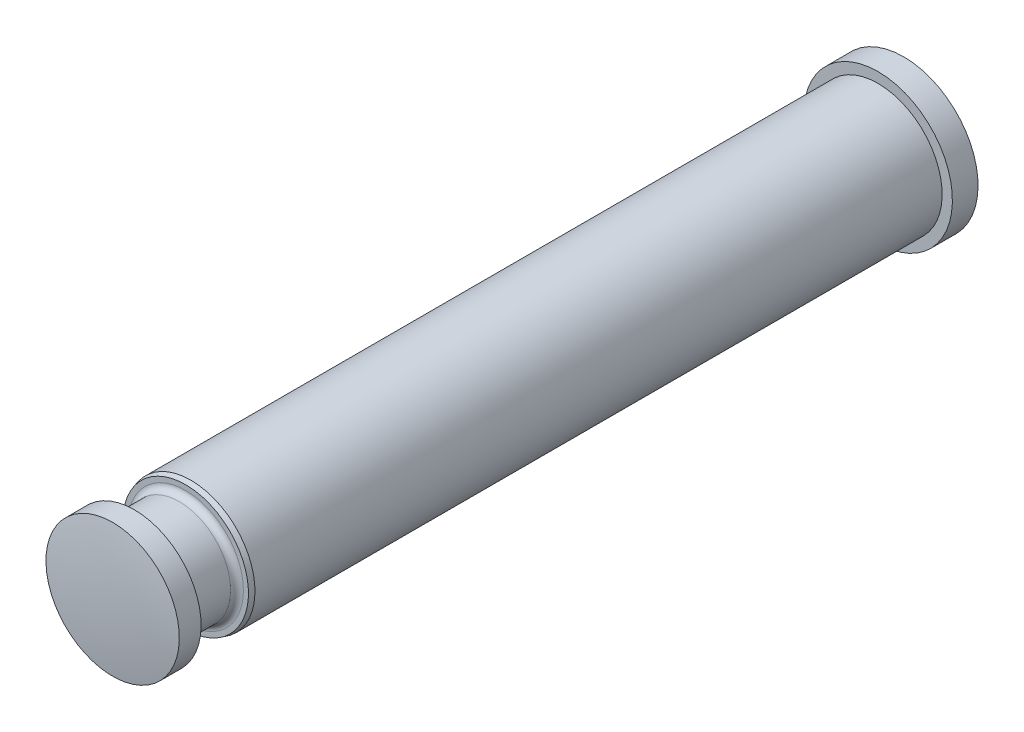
ISO-10303-21;
HEADER;
FILE_DESCRIPTION(('STEP AP214'),'2;1');
FILE_NAME('part.step','',(''),(''),'','','');
FILE_SCHEMA(('AUTOMOTIVE_DESIGN { 1 0 10303 214 1 1 1 1 }'));
ENDSEC;
DATA;
#1=APPLICATION_CONTEXT('core data for automotive mechanical design processes');
#2=APPLICATION_PROTOCOL_DEFINITION('international standard','automotive_design',2000,#1);
#3=PRODUCT_CONTEXT('',#1,'mechanical');
#4=PRODUCT('Part','Part','',(#3));
#5=PRODUCT_RELATED_PRODUCT_CATEGORY('part','',(#4));
#6=PRODUCT_DEFINITION_FORMATION('','',#4);
#7=PRODUCT_DEFINITION_CONTEXT('part definition',#1,'design');
#8=PRODUCT_DEFINITION('design','',#6,#7);
#9=PRODUCT_DEFINITION_SHAPE('','',#8);
#10=(LENGTH_UNIT() NAMED_UNIT(*) SI_UNIT(.MILLI.,.METRE.));
#11=(NAMED_UNIT(*) PLANE_ANGLE_UNIT() SI_UNIT($,.RADIAN.));
#12=(NAMED_UNIT(*) SI_UNIT($,.STERADIAN.) SOLID_ANGLE_UNIT());
#13=UNCERTAINTY_MEASURE_WITH_UNIT(LENGTH_MEASURE(1.E-05),#10,'distance_accuracy_value','');
#14=(GEOMETRIC_REPRESENTATION_CONTEXT(3) GLOBAL_UNCERTAINTY_ASSIGNED_CONTEXT((#13)) GLOBAL_UNIT_ASSIGNED_CONTEXT((#10,
#11,#12)) REPRESENTATION_CONTEXT('',''));
#15=CARTESIAN_POINT('',(0.,0.,0.));
#16=DIRECTION('',(0.,0.,1.));
#17=DIRECTION('',(1.,0.,0.));
#18=AXIS2_PLACEMENT_3D('',#15,#16,#17);
#19=CARTESIAN_POINT('',(0.,0.,-1.45));
#20=DIRECTION('',(1.,0.,0.));
#21=DIRECTION('',(0.,1.,0.));
#22=AXIS2_PLACEMENT_3D('',#19,#20,#21);
#23=SPHERICAL_SURFACE('',#22,17.);
#24=CARTESIAN_POINT('',(0.,0.,15.35));
#25=DIRECTION('',(0.,0.,-1.));
#26=DIRECTION('',(0.,1.,0.));
#27=AXIS2_PLACEMENT_3D('',#24,#25,#26);
#28=CIRCLE('',#27,2.6);
#29=CARTESIAN_POINT('',(0.,2.6,15.35));
#30=VERTEX_POINT('',#29);
#31=EDGE_CURVE('E21',#30,#30,#28,.T.);
#32=ORIENTED_EDGE('',*,*,#31,.F.);
#33=EDGE_LOOP('',(#32));
#34=FACE_BOUND('',#33,.T.);
#35=ADVANCED_FACE('F17',(#34),#23,.T.);
#36=CARTESIAN_POINT('',(0.,0.,-0.075));
#37=DIRECTION('',(0.,0.,-1.));
#38=DIRECTION('',(0.,1.,0.));
#39=AXIS2_PLACEMENT_3D('',#36,#37,#38);
#40=CYLINDRICAL_SURFACE('',#39,2.6);
#41=ORIENTED_EDGE('',*,*,#31,.T.);
#42=EDGE_LOOP('',(#41));
#43=FACE_BOUND('',#42,.T.);
#44=CARTESIAN_POINT('',(0.,0.,14.4999999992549));
#45=DIRECTION('',(0.,0.,-1.));
#46=DIRECTION('',(0.,1.,0.));
#47=AXIS2_PLACEMENT_3D('',#44,#45,#46);
#48=CIRCLE('',#47,2.6);
#49=CARTESIAN_POINT('',(0.,2.6,14.4999999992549));
#50=VERTEX_POINT('',#49);
#51=EDGE_CURVE('E111',#50,#50,#48,.T.);
#52=ORIENTED_EDGE('',*,*,#51,.F.);
#53=EDGE_LOOP('',(#52));
#54=FACE_BOUND('',#53,.T.);
#55=ADVANCED_FACE('F118',(#43,#54),#40,.T.);
#56=CARTESIAN_POINT('',(0.,2.,14.5));
#57=DIRECTION('',(0.,0.,-1.));
#58=DIRECTION('',(0.,1.,0.));
#59=AXIS2_PLACEMENT_3D('',#56,#57,#58);
#60=PLANE('',#59);
#61=CARTESIAN_POINT('',(0.,0.,14.5));
#62=DIRECTION('',(0.,0.,-1.));
#63=DIRECTION('',(0.,1.,0.));
#64=AXIS2_PLACEMENT_3D('',#61,#62,#63);
#65=CIRCLE('',#64,2.);
#66=CARTESIAN_POINT('',(0.,2.,14.5));
#67=VERTEX_POINT('',#66);
#68=EDGE_CURVE('E109',#67,#67,#65,.T.);
#69=ORIENTED_EDGE('',*,*,#68,.F.);
#70=EDGE_LOOP('',(#69));
#71=FACE_BOUND('',#70,.T.);
#72=ORIENTED_EDGE('',*,*,#51,.T.);
#73=EDGE_LOOP('',(#72));
#74=FACE_BOUND('',#73,.T.);
#75=ADVANCED_FACE('F126',(#71,#74),#60,.T.);
#76=CARTESIAN_POINT('',(0.,0.,-0.075));
#77=DIRECTION('',(0.,0.,-1.));
#78=DIRECTION('',(0.,1.,0.));
#79=AXIS2_PLACEMENT_3D('',#76,#77,#78);
#80=CYLINDRICAL_SURFACE('',#79,2.);
#81=ORIENTED_EDGE('',*,*,#68,.T.);
#82=EDGE_LOOP('',(#81));
#83=FACE_BOUND('',#82,.T.);
#84=CARTESIAN_POINT('',(0.,0.,12.7500001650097));
#85=DIRECTION('',(0.,0.,-1.));
#86=DIRECTION('',(-1.,0.,0.));
#87=AXIS2_PLACEMENT_3D('',#84,#85,#86);
#88=CIRCLE('',#87,2.00000000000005);
#89=CARTESIAN_POINT('',(-2.00000000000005,0.,12.7500001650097));
#90=VERTEX_POINT('',#89);
#91=EDGE_CURVE('E47',#90,#90,#88,.F.);
#92=ORIENTED_EDGE('',*,*,#91,.T.);
#93=EDGE_LOOP('',(#92));
#94=FACE_BOUND('',#93,.T.);
#95=ADVANCED_FACE('F86',(#83,#94),#80,.T.);
#96=CARTESIAN_POINT('',(0.,0.,12.75));
#97=DIRECTION('',(0.,0.,-1.));
#98=DIRECTION('',(-1.,0.,0.));
#99=AXIS2_PLACEMENT_3D('',#96,#97,#98);
#100=TOROIDAL_SURFACE('',#99,2.25,0.25);
#101=ORIENTED_EDGE('',*,*,#91,.F.);
#102=EDGE_LOOP('',(#101));
#103=FACE_BOUND('',#102,.T.);
#104=CARTESIAN_POINT('',(0.,0.,12.5));
#105=DIRECTION('',(0.,0.,1.));
#106=DIRECTION('',(-0.479425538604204,-0.877582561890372,0.));
#107=AXIS2_PLACEMENT_3D('',#104,#105,#106);
#108=CIRCLE('',#107,2.25);
#109=CARTESIAN_POINT('',(-1.0787074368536,-1.97456071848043,12.5));
#110=VERTEX_POINT('',#109);
#111=CARTESIAN_POINT('',(1.07870745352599,1.9745607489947,12.5));
#112=VERTEX_POINT('',#111);
#113=EDGE_CURVE('E36',#110,#112,#108,.T.);
#114=ORIENTED_EDGE('',*,*,#113,.T.);
#115=CARTESIAN_POINT('',(0.,0.,12.5));
#116=DIRECTION('',(0.,0.,1.));
#117=DIRECTION('',(0.479425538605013,0.87758256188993,0.));
#118=AXIS2_PLACEMENT_3D('',#115,#116,#117);
#119=CIRCLE('',#118,2.24999993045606);
#120=EDGE_CURVE('E33',#112,#110,#119,.T.);
#121=ORIENTED_EDGE('',*,*,#120,.T.);
#122=EDGE_LOOP('',(#114,#121));
#123=FACE_BOUND('',#122,.T.);
#124=ADVANCED_FACE('F38',(#103,#123),#100,.F.);
#125=CARTESIAN_POINT('',(0.,0.,5.425));
#126=DIRECTION('',(1.,0.,0.));
#127=DIRECTION('',(0.,1.,0.));
#128=AXIS2_PLACEMENT_3D('',#125,#126,#127);
#129=SPHERICAL_SURFACE('',#128,21.125);
#130=CARTESIAN_POINT('',(0.,0.,-15.5));
#131=DIRECTION('',(0.,0.,-1.));
#132=DIRECTION('',(0.,1.,0.));
#133=AXIS2_PLACEMENT_3D('',#130,#131,#132);
#134=CIRCLE('',#133,2.9);
#135=CARTESIAN_POINT('',(0.,2.9,-15.5));
#136=VERTEX_POINT('',#135);
#137=EDGE_CURVE('E41',#136,#136,#134,.F.);
#138=ORIENTED_EDGE('',*,*,#137,.F.);
#139=EDGE_LOOP('',(#138));
#140=FACE_BOUND('',#139,.T.);
#141=ADVANCED_FACE('F63',(#140),#129,.T.);
#142=CARTESIAN_POINT('',(0.,2.5,12.5));
#143=DIRECTION('',(0.,0.,-1.));
#144=DIRECTION('',(0.,1.,0.));
#145=AXIS2_PLACEMENT_3D('',#142,#143,#144);
#146=PLANE('',#145);
#147=ORIENTED_EDGE('',*,*,#120,.F.);
#148=ORIENTED_EDGE('',*,*,#113,.F.);
#149=EDGE_LOOP('',(#147,#148));
#150=FACE_BOUND('',#149,.T.);
#151=CARTESIAN_POINT('',(2.86260175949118E-13,-1.90458052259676E-13,12.4999999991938));
#152=DIRECTION('',(-1.42859037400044E-12,9.42532441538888E-13,-1.));
#153=DIRECTION('',(-1.,0.,1.42859037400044E-12));
#154=AXIS2_PLACEMENT_3D('',#151,#152,#153);
#155=CIRCLE('',#154,2.44641015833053);
#156=CARTESIAN_POINT('',(-2.44641015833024,-1.90458052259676E-13,12.4999999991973));
#157=VERTEX_POINT('',#156);
#158=EDGE_CURVE('E104',#157,#157,#155,.T.);
#159=ORIENTED_EDGE('',*,*,#158,.F.);
#160=EDGE_LOOP('',(#159));
#161=FACE_BOUND('',#160,.T.);
#162=ADVANCED_FACE('F45',(#150,#161),#146,.F.);
#163=CARTESIAN_POINT('',(0.,0.,-0.075));
#164=DIRECTION('',(0.,0.,-1.));
#165=DIRECTION('',(0.,1.,0.));
#166=AXIS2_PLACEMENT_3D('',#163,#164,#165);
#167=CYLINDRICAL_SURFACE('',#166,2.9);
#168=CARTESIAN_POINT('',(0.,0.,-14.5000000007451));
#169=DIRECTION('',(0.,0.,-1.));
#170=DIRECTION('',(0.,1.,0.));
#171=AXIS2_PLACEMENT_3D('',#168,#169,#170);
#172=CIRCLE('',#171,2.9);
#173=CARTESIAN_POINT('',(0.,2.9,-14.5000000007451));
#174=VERTEX_POINT('',#173);
#175=EDGE_CURVE('E78',#174,#174,#172,.T.);
#176=ORIENTED_EDGE('',*,*,#175,.T.);
#177=EDGE_LOOP('',(#176));
#178=FACE_BOUND('',#177,.T.);
#179=ORIENTED_EDGE('',*,*,#137,.T.);
#180=EDGE_LOOP('',(#179));
#181=FACE_BOUND('',#180,.T.);
#182=ADVANCED_FACE('F62',(#178,#181),#167,.T.);
#183=CARTESIAN_POINT('',(0.,0.,12.2999999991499));
#184=DIRECTION('',(-1.42859037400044E-12,9.42532441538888E-13,-1.));
#185=DIRECTION('',(-1.,0.,1.42859037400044E-12));
#186=AXIS2_PLACEMENT_3D('',#183,#184,#185);
#187=CONICAL_SURFACE('',#186,2.49999999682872,0.261799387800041);
#188=ORIENTED_EDGE('',*,*,#158,.T.);
#189=EDGE_LOOP('',(#188));
#190=FACE_BOUND('',#189,.T.);
#191=CARTESIAN_POINT('',(0.,0.,12.2999999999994));
#192=DIRECTION('',(0.,0.,-1.));
#193=DIRECTION('',(0.,1.,0.));
#194=AXIS2_PLACEMENT_3D('',#191,#192,#193);
#195=CIRCLE('',#194,2.5);
#196=CARTESIAN_POINT('',(0.,2.5,12.2999999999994));
#197=VERTEX_POINT('',#196);
#198=EDGE_CURVE('E27',#197,#197,#195,.T.);
#199=ORIENTED_EDGE('',*,*,#198,.F.);
#200=EDGE_LOOP('',(#199));
#201=FACE_BOUND('',#200,.T.);
#202=ADVANCED_FACE('F135',(#190,#201),#187,.T.);
#203=CARTESIAN_POINT('',(0.,2.5,-14.5));
#204=DIRECTION('',(0.,0.,-1.));
#205=DIRECTION('',(0.,1.,0.));
#206=AXIS2_PLACEMENT_3D('',#203,#204,#205);
#207=PLANE('',#206);
#208=CARTESIAN_POINT('',(0.,0.,-14.5));
#209=DIRECTION('',(0.,0.,-1.));
#210=DIRECTION('',(0.,1.,0.));
#211=AXIS2_PLACEMENT_3D('',#208,#209,#210);
#212=CIRCLE('',#211,2.5);
#213=CARTESIAN_POINT('',(0.,2.5,-14.5));
#214=VERTEX_POINT('',#213);
#215=EDGE_CURVE('E11',#214,#214,#212,.F.);
#216=ORIENTED_EDGE('',*,*,#215,.F.);
#217=EDGE_LOOP('',(#216));
#218=FACE_BOUND('',#217,.T.);
#219=ORIENTED_EDGE('',*,*,#175,.F.);
#220=EDGE_LOOP('',(#219));
#221=FACE_BOUND('',#220,.T.);
#222=ADVANCED_FACE('F129',(#218,#221),#207,.F.);
#223=CARTESIAN_POINT('',(0.,0.,-0.075));
#224=DIRECTION('',(0.,0.,-1.));
#225=DIRECTION('',(0.,1.,0.));
#226=AXIS2_PLACEMENT_3D('',#223,#224,#225);
#227=CYLINDRICAL_SURFACE('',#226,2.5);
#228=ORIENTED_EDGE('',*,*,#215,.T.);
#229=EDGE_LOOP('',(#228));
#230=FACE_BOUND('',#229,.T.);
#231=ORIENTED_EDGE('',*,*,#198,.T.);
#232=EDGE_LOOP('',(#231));
#233=FACE_BOUND('',#232,.T.);
#234=ADVANCED_FACE('F127',(#230,#233),#227,.T.);
#235=CLOSED_SHELL('',(#35,#55,#75,#95,#124,#141,#162,#182,#202,#222,#234));
#236=MANIFOLD_SOLID_BREP('B1',#235);
#237=ADVANCED_BREP_SHAPE_REPRESENTATION('',(#18,#236),#14);
#238=SHAPE_DEFINITION_REPRESENTATION(#9,#237);
ENDSEC;
END-ISO-10303-21;
